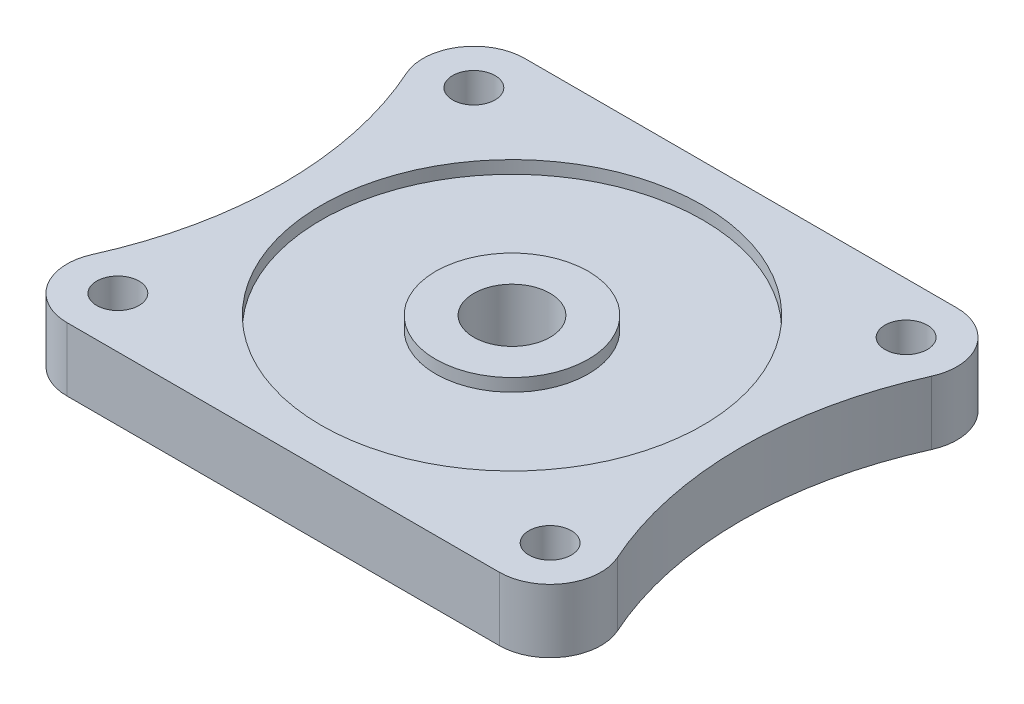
from build123d import *

# Parameters (mm, degrees)
SKETCH1_R           = 5
BOSS_EXTRUDE1_DEPTH = 7.5
SKETCH2_R           = 9
CUT_EXTRUDE1_DEPTH  = 85.320815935
SKETCH3_R           = 45
SKETCH3_R_2         = 18
CUT_EXTRUDE2_DEPTH  = 3


with BuildPart() as part:
    # Sketch1 → Boss-Extrude1 (new, symmetric)
    with BuildSketch(Plane(origin=(0, 0, 0), x_dir=(1, 0, 0), z_dir=(0, 1, 0))):
        with BuildLine():
            Line((-51, 54), (51, 54))
            ThreePointArc((51, 54), (61.074841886, 48.519015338), (61.946341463, 37.082926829))
            ThreePointArc((61.946341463, 37.082926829), (54, 0), (61.946341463, -37.082926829))
            ThreePointArc((61.946341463, -37.082926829), (61.074841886, -48.519015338), (51, -54))
            Line((51, -54), (-51, -54))
            ThreePointArc((-51, -54), (-61.074841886, -48.519015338), (-61.946341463, -37.082926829))
            ThreePointArc((-61.946341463, -37.082926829), (-54, 0), (-61.946341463, 37.082926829))
            ThreePointArc((-61.946341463, 37.082926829), (-61.074841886, 48.519015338), (-51, 54))
        make_face()
        with Locations(Location((-51, 42, 0), (0, 0, 270))):
            Circle(SKETCH1_R, mode=Mode.SUBTRACT)
        with Locations(Location((51, 42, 0), (0, 0, 270))):
            Circle(SKETCH1_R, mode=Mode.SUBTRACT)
        with Locations(Location((51, -42, 0), (0, 0, 270))):
            Circle(SKETCH1_R, mode=Mode.SUBTRACT)
        with Locations(Location((-51, -42, 0), (0, 0, 270))):
            Circle(SKETCH1_R, mode=Mode.SUBTRACT)
    extrude(amount=BOSS_EXTRUDE1_DEPTH, both=True)

    # Sketch2 → Cut-Extrude1 (cut, through all)
    with BuildSketch(Plane(origin=(0, 7.5, 0), x_dir=(1, 0, 0), z_dir=(0, 1, 0))):
        with Locations(Location((0, 0, 0), (0, 0, 270))):
            Circle(SKETCH2_R)
    extrude(amount=-CUT_EXTRUDE1_DEPTH, mode=Mode.SUBTRACT)

    # Sketch3 → Cut-Extrude2 (cut)
    with BuildSketch(Plane(origin=(0, 7.5, 0), x_dir=(1, 0, 0), z_dir=(0, 1, 0))):
        with Locations(Location((0, 0, 0), (0, 0, 270))):
            Circle(SKETCH3_R)
        with Locations(Location((0, 0, 0), (0, 0, 270))):
            Circle(SKETCH3_R_2, mode=Mode.SUBTRACT)
    cut_extrude2 = extrude(amount=-CUT_EXTRUDE2_DEPTH, mode=Mode.SUBTRACT)

    # Mirror1: Cut-Extrude2 across plane
    add(cut_extrude2.mirror(Plane.ZX), mode=Mode.SUBTRACT)


solid = part.part
